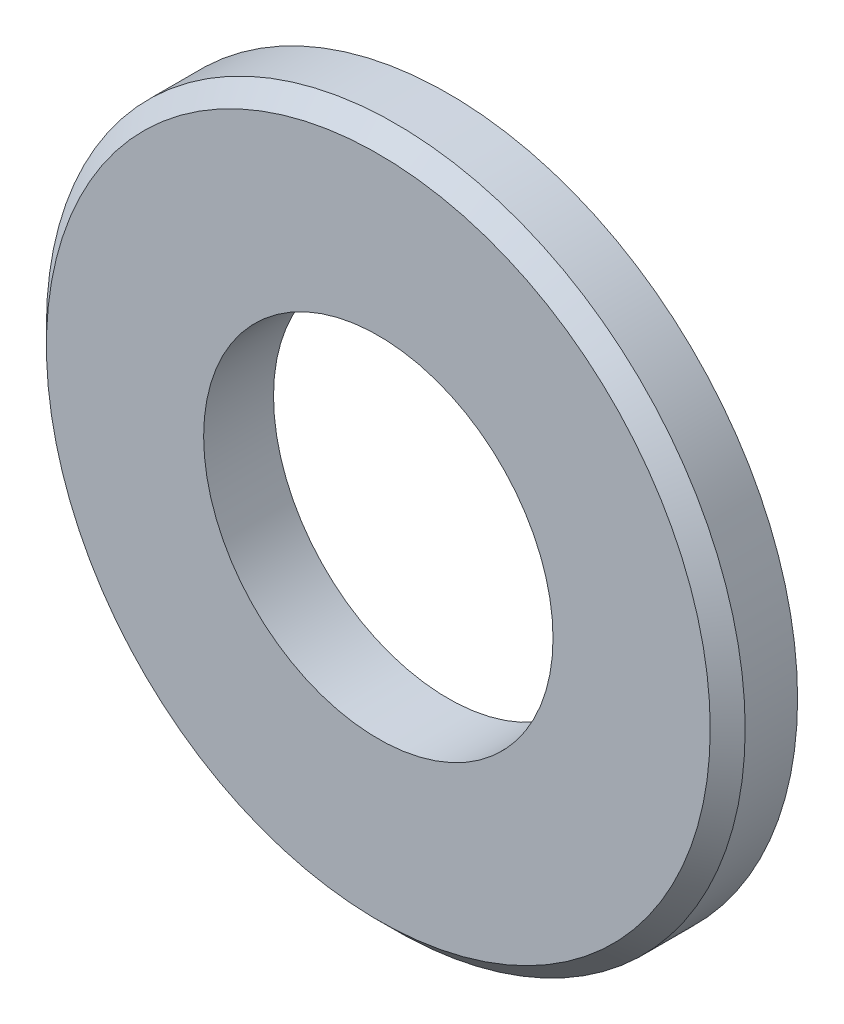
from build123d import *

# Parameters (mm, degrees)
SKETCH1_R          = 5
SKETCH1_R_2        = 2.5
BASE_EXTRUDE_DEPTH = 1
CHAMFER1_SIZE      = 0.25


with BuildPart() as part:
    # Sketch1 → Base-Extrude (new body)
    with BuildSketch(Plane.XY):
        Circle(SKETCH1_R)
        Circle(SKETCH1_R_2, mode=Mode.SUBTRACT)
    extrude(amount=-BASE_EXTRUDE_DEPTH)

    # Chamfer1
    chamfer1_edges = [part.edges().sort_by_distance(p)[0] for p in [
        (-5, 0, 0),
    ]]
    chamfer(chamfer1_edges, length=CHAMFER1_SIZE)


solid = part.part
